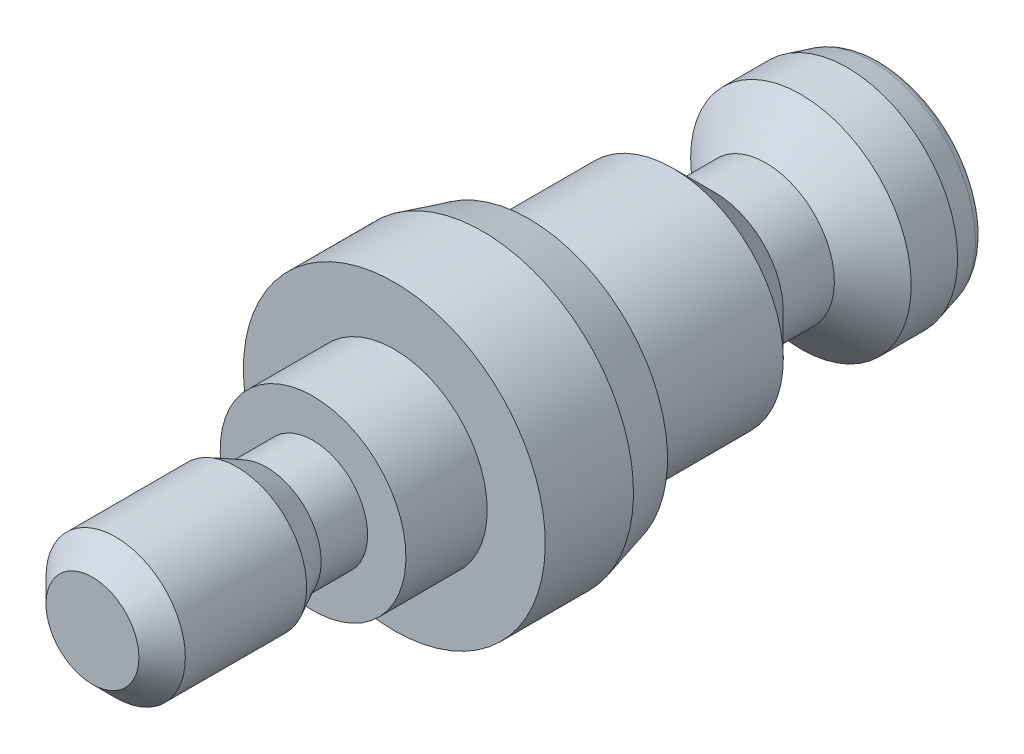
ISO-10303-21;
HEADER;
FILE_DESCRIPTION(('STEP AP214'),'2;1');
FILE_NAME('part.step','',(''),(''),'','','');
FILE_SCHEMA(('AUTOMOTIVE_DESIGN { 1 0 10303 214 1 1 1 1 }'));
ENDSEC;
DATA;
#1=APPLICATION_CONTEXT('core data for automotive mechanical design processes');
#2=APPLICATION_PROTOCOL_DEFINITION('international standard','automotive_design',2000,#1);
#3=PRODUCT_CONTEXT('',#1,'mechanical');
#4=PRODUCT('Part','Part','',(#3));
#5=PRODUCT_RELATED_PRODUCT_CATEGORY('part','',(#4));
#6=PRODUCT_DEFINITION_FORMATION('','',#4);
#7=PRODUCT_DEFINITION_CONTEXT('part definition',#1,'design');
#8=PRODUCT_DEFINITION('design','',#6,#7);
#9=PRODUCT_DEFINITION_SHAPE('','',#8);
#10=(LENGTH_UNIT() NAMED_UNIT(*) SI_UNIT(.MILLI.,.METRE.));
#11=(NAMED_UNIT(*) PLANE_ANGLE_UNIT() SI_UNIT($,.RADIAN.));
#12=(NAMED_UNIT(*) SI_UNIT($,.STERADIAN.) SOLID_ANGLE_UNIT());
#13=UNCERTAINTY_MEASURE_WITH_UNIT(LENGTH_MEASURE(1.E-05),#10,'distance_accuracy_value','');
#14=(GEOMETRIC_REPRESENTATION_CONTEXT(3) GLOBAL_UNCERTAINTY_ASSIGNED_CONTEXT((#13)) GLOBAL_UNIT_ASSIGNED_CONTEXT((#10,
#11,#12)) REPRESENTATION_CONTEXT('',''));
#15=CARTESIAN_POINT('',(0.,0.,0.));
#16=DIRECTION('',(0.,0.,1.));
#17=DIRECTION('',(1.,0.,0.));
#18=AXIS2_PLACEMENT_3D('',#15,#16,#17);
#19=CARTESIAN_POINT('',(0.,0.,0.));
#20=DIRECTION('',(0.,0.,-1.));
#21=DIRECTION('',(0.,1.,0.));
#22=AXIS2_PLACEMENT_3D('',#19,#20,#21);
#23=CYLINDRICAL_SURFACE('',#22,4.75);
#24=CARTESIAN_POINT('',(0.,0.,-12.));
#25=DIRECTION('',(0.,0.,-1.));
#26=DIRECTION('',(0.,1.,0.));
#27=AXIS2_PLACEMENT_3D('',#24,#25,#26);
#28=CIRCLE('',#27,4.75);
#29=CARTESIAN_POINT('',(0.,4.75000000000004,-12.));
#30=VERTEX_POINT('',#29);
#31=EDGE_CURVE('E142',#30,#30,#28,.T.);
#32=ORIENTED_EDGE('',*,*,#31,.F.);
#33=EDGE_LOOP('',(#32));
#34=FACE_BOUND('',#33,.T.);
#35=CARTESIAN_POINT('',(0.,0.,-5.8));
#36=DIRECTION('',(0.,0.,1.));
#37=DIRECTION('',(0.,-1.,0.));
#38=AXIS2_PLACEMENT_3D('',#35,#36,#37);
#39=CIRCLE('',#38,4.75);
#40=CARTESIAN_POINT('',(0.,-4.74999999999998,-5.80000000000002));
#41=VERTEX_POINT('',#40);
#42=EDGE_CURVE('E127',#41,#41,#39,.T.);
#43=ORIENTED_EDGE('',*,*,#42,.F.);
#44=EDGE_LOOP('',(#43));
#45=FACE_BOUND('',#44,.T.);
#46=ADVANCED_FACE('F16',(#34,#45),#23,.T.);
#47=CARTESIAN_POINT('',(0.,0.,-13.8));
#48=DIRECTION('',(0.,0.,1.));
#49=DIRECTION('',(0.,-1.,0.));
#50=AXIS2_PLACEMENT_3D('',#47,#48,#49);
#51=CONICAL_SURFACE('',#50,2.95,0.785398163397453);
#52=ORIENTED_EDGE('',*,*,#31,.T.);
#53=EDGE_LOOP('',(#52));
#54=FACE_BOUND('',#53,.T.);
#55=CARTESIAN_POINT('',(0.,0.,-13.8));
#56=DIRECTION('',(0.,0.,-1.));
#57=DIRECTION('',(0.,1.,0.));
#58=AXIS2_PLACEMENT_3D('',#55,#56,#57);
#59=CIRCLE('',#58,2.95);
#60=CARTESIAN_POINT('',(0.,2.95000000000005,-13.8));
#61=VERTEX_POINT('',#60);
#62=EDGE_CURVE('E139',#61,#61,#59,.T.);
#63=ORIENTED_EDGE('',*,*,#62,.F.);
#64=EDGE_LOOP('',(#63));
#65=FACE_BOUND('',#64,.T.);
#66=ADVANCED_FACE('F175',(#54,#65),#51,.T.);
#67=CARTESIAN_POINT('',(0.,0.,0.));
#68=DIRECTION('',(0.,0.,-1.));
#69=DIRECTION('',(0.,1.,0.));
#70=AXIS2_PLACEMENT_3D('',#67,#68,#69);
#71=CYLINDRICAL_SURFACE('',#70,2.95);
#72=ORIENTED_EDGE('',*,*,#62,.T.);
#73=EDGE_LOOP('',(#72));
#74=FACE_BOUND('',#73,.T.);
#75=CARTESIAN_POINT('',(0.,0.,-16.));
#76=DIRECTION('',(0.,0.,-1.));
#77=DIRECTION('',(0.,1.,0.));
#78=AXIS2_PLACEMENT_3D('',#75,#76,#77);
#79=CIRCLE('',#78,2.95);
#80=CARTESIAN_POINT('',(0.,2.95000000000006,-16.));
#81=VERTEX_POINT('',#80);
#82=EDGE_CURVE('E136',#81,#81,#79,.T.);
#83=ORIENTED_EDGE('',*,*,#82,.F.);
#84=EDGE_LOOP('',(#83));
#85=FACE_BOUND('',#84,.T.);
#86=ADVANCED_FACE('F181',(#74,#85),#71,.T.);
#87=CARTESIAN_POINT('',(0.,0.,-17.5103793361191));
#88=DIRECTION('',(0.,0.,-1.));
#89=DIRECTION('',(0.,1.,0.));
#90=AXIS2_PLACEMENT_3D('',#87,#88,#89);
#91=CONICAL_SURFACE('',#90,4.75,0.872664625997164);
#92=ORIENTED_EDGE('',*,*,#82,.T.);
#93=EDGE_LOOP('',(#92));
#94=FACE_BOUND('',#93,.T.);
#95=CARTESIAN_POINT('',(0.,0.,-17.5103793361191));
#96=DIRECTION('',(0.,0.,-1.));
#97=DIRECTION('',(0.,1.,0.));
#98=AXIS2_PLACEMENT_3D('',#95,#96,#97);
#99=CIRCLE('',#98,4.75);
#100=CARTESIAN_POINT('',(0.,4.75000000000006,-17.5103793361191));
#101=VERTEX_POINT('',#100);
#102=EDGE_CURVE('E133',#101,#101,#99,.T.);
#103=ORIENTED_EDGE('',*,*,#102,.F.);
#104=EDGE_LOOP('',(#103));
#105=FACE_BOUND('',#104,.T.);
#106=ADVANCED_FACE('F230',(#94,#105),#91,.T.);
#107=CARTESIAN_POINT('',(0.,0.,0.));
#108=DIRECTION('',(0.,0.,-1.));
#109=DIRECTION('',(0.,1.,0.));
#110=AXIS2_PLACEMENT_3D('',#107,#108,#109);
#111=CYLINDRICAL_SURFACE('',#110,4.75);
#112=ORIENTED_EDGE('',*,*,#102,.T.);
#113=EDGE_LOOP('',(#112));
#114=FACE_BOUND('',#113,.T.);
#115=CARTESIAN_POINT('',(0.,0.,-19.5103793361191));
#116=DIRECTION('',(0.,0.,-1.));
#117=DIRECTION('',(0.,1.,0.));
#118=AXIS2_PLACEMENT_3D('',#115,#116,#117);
#119=CIRCLE('',#118,4.75);
#120=CARTESIAN_POINT('',(0.,4.75000000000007,-19.5103793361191));
#121=VERTEX_POINT('',#120);
#122=EDGE_CURVE('E130',#121,#121,#119,.T.);
#123=ORIENTED_EDGE('',*,*,#122,.F.);
#124=EDGE_LOOP('',(#123));
#125=FACE_BOUND('',#124,.T.);
#126=ADVANCED_FACE('F221',(#114,#125),#111,.T.);
#127=CARTESIAN_POINT('',(0.,0.,-21.));
#128=DIRECTION('',(0.,0.,1.));
#129=DIRECTION('',(0.,-1.,0.));
#130=AXIS2_PLACEMENT_3D('',#127,#128,#129);
#131=CONICAL_SURFACE('',#130,4.3508573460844,0.26179938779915);
#132=CARTESIAN_POINT('',(0.,0.,-20.5552914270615));
#133=DIRECTION('',(0.,0.,-1.));
#134=DIRECTION('',(0.,1.,0.));
#135=AXIS2_PLACEMENT_3D('',#132,#133,#134);
#136=CIRCLE('',#135,4.47001664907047);
#137=CARTESIAN_POINT('',(0.,4.47001664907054,-20.5552914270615));
#138=VERTEX_POINT('',#137);
#139=EDGE_CURVE('E157',#138,#138,#136,.F.);
#140=ORIENTED_EDGE('',*,*,#139,.T.);
#141=EDGE_LOOP('',(#140));
#142=FACE_BOUND('',#141,.T.);
#143=ORIENTED_EDGE('',*,*,#122,.T.);
#144=EDGE_LOOP('',(#143));
#145=FACE_BOUND('',#144,.T.);
#146=ADVANCED_FACE('F213',(#142,#145),#131,.T.);
#147=CARTESIAN_POINT('',(4.3508573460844,0.,-21.));
#148=DIRECTION('',(0.,0.,-1.));
#149=DIRECTION('',(0.,1.,0.));
#150=AXIS2_PLACEMENT_3D('',#147,#148,#149);
#151=PLANE('',#150);
#152=DIRECTION('',(-0.866025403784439,0.5,0.));
#153=VECTOR('',#152,1.);
#154=CARTESIAN_POINT('',(0.,-1.73205080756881,-21.));
#155=LINE('',#154,#153);
#156=CARTESIAN_POINT('',(0.,-1.73205080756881,-21.));
#157=VERTEX_POINT('',#156);
#158=CARTESIAN_POINT('',(-1.5,-0.866025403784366,-21.));
#159=VERTEX_POINT('',#158);
#160=EDGE_CURVE('E448',#157,#159,#155,.T.);
#161=ORIENTED_EDGE('',*,*,#160,.F.);
#162=DIRECTION('',(-0.866025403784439,-0.5,0.));
#163=VECTOR('',#162,1.);
#164=CARTESIAN_POINT('',(1.5,-0.866025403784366,-21.));
#165=LINE('',#164,#163);
#166=CARTESIAN_POINT('',(1.5,-0.866025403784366,-21.));
#167=VERTEX_POINT('',#166);
#168=EDGE_CURVE('E99',#167,#157,#165,.T.);
#169=ORIENTED_EDGE('',*,*,#168,.F.);
#170=DIRECTION('',(0.,-1.,0.));
#171=VECTOR('',#170,1.);
#172=CARTESIAN_POINT('',(1.5,0.866025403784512,-21.));
#173=LINE('',#172,#171);
#174=CARTESIAN_POINT('',(1.5,0.866025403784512,-21.));
#175=VERTEX_POINT('',#174);
#176=EDGE_CURVE('E436',#175,#167,#173,.T.);
#177=ORIENTED_EDGE('',*,*,#176,.F.);
#178=DIRECTION('',(0.866025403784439,-0.5,0.));
#179=VECTOR('',#178,1.);
#180=CARTESIAN_POINT('',(0.,1.73205080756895,-21.));
#181=LINE('',#180,#179);
#182=CARTESIAN_POINT('',(0.,1.73205080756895,-21.));
#183=VERTEX_POINT('',#182);
#184=EDGE_CURVE('E435',#183,#175,#181,.T.);
#185=ORIENTED_EDGE('',*,*,#184,.F.);
#186=DIRECTION('',(0.866025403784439,0.5,0.));
#187=VECTOR('',#186,1.);
#188=CARTESIAN_POINT('',(-1.5,0.866025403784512,-21.));
#189=LINE('',#188,#187);
#190=CARTESIAN_POINT('',(-1.5,0.866025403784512,-21.));
#191=VERTEX_POINT('',#190);
#192=EDGE_CURVE('E437',#191,#183,#189,.T.);
#193=ORIENTED_EDGE('',*,*,#192,.F.);
#194=DIRECTION('',(0.,1.,0.));
#195=VECTOR('',#194,1.);
#196=CARTESIAN_POINT('',(-1.5,-0.866025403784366,-21.));
#197=LINE('',#196,#195);
#198=EDGE_CURVE('E56',#159,#191,#197,.T.);
#199=ORIENTED_EDGE('',*,*,#198,.F.);
#200=EDGE_LOOP('',(#161,#169,#177,#185,#193,#199));
#201=FACE_BOUND('',#200,.T.);
#202=CARTESIAN_POINT('',(0.,0.,-21.));
#203=DIRECTION('',(0.,0.,-1.));
#204=DIRECTION('',(0.,1.,0.));
#205=AXIS2_PLACEMENT_3D('',#202,#203,#204);
#206=CIRCLE('',#205,3.89046115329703);
#207=CARTESIAN_POINT('',(0.,3.8904611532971,-21.));
#208=VERTEX_POINT('',#207);
#209=EDGE_CURVE('E154',#208,#208,#206,.T.);
#210=ORIENTED_EDGE('',*,*,#209,.T.);
#211=EDGE_LOOP('',(#210));
#212=FACE_BOUND('',#211,.T.);
#213=ADVANCED_FACE('F210',(#201,#212),#151,.T.);
#214=CARTESIAN_POINT('',(4.75,0.,-5.8));
#215=DIRECTION('',(0.,0.,1.));
#216=DIRECTION('',(0.,-1.,0.));
#217=AXIS2_PLACEMENT_3D('',#214,#215,#216);
#218=PLANE('',#217);
#219=CARTESIAN_POINT('',(0.,0.,-5.8));
#220=DIRECTION('',(0.,0.,1.));
#221=DIRECTION('',(0.,-1.,0.));
#222=AXIS2_PLACEMENT_3D('',#219,#220,#221);
#223=CIRCLE('',#222,5.96410161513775);
#224=CARTESIAN_POINT('',(0.,-5.96410161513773,-5.80000000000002));
#225=VERTEX_POINT('',#224);
#226=EDGE_CURVE('E10',#225,#225,#223,.F.);
#227=ORIENTED_EDGE('',*,*,#226,.T.);
#228=EDGE_LOOP('',(#227));
#229=FACE_BOUND('',#228,.T.);
#230=ORIENTED_EDGE('',*,*,#42,.T.);
#231=EDGE_LOOP('',(#230));
#232=FACE_BOUND('',#231,.T.);
#233=ADVANCED_FACE('F212',(#229,#232),#218,.F.);
#234=CARTESIAN_POINT('',(0.,0.,0.));
#235=DIRECTION('',(0.,0.,1.));
#236=DIRECTION('',(0.,-1.,0.));
#237=AXIS2_PLACEMENT_3D('',#234,#235,#236);
#238=CYLINDRICAL_SURFACE('',#237,6.5);
#239=CARTESIAN_POINT('',(0.,0.,-3.8));
#240=DIRECTION('',(0.,0.,1.));
#241=DIRECTION('',(0.,-1.,0.));
#242=AXIS2_PLACEMENT_3D('',#239,#240,#241);
#243=CIRCLE('',#242,6.5);
#244=CARTESIAN_POINT('',(0.,-6.49999999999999,-3.80000000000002));
#245=VERTEX_POINT('',#244);
#246=EDGE_CURVE('E25',#245,#245,#243,.T.);
#247=ORIENTED_EDGE('',*,*,#246,.T.);
#248=EDGE_LOOP('',(#247));
#249=FACE_BOUND('',#248,.T.);
#250=CARTESIAN_POINT('',(0.,0.,0.));
#251=DIRECTION('',(0.,0.,1.));
#252=DIRECTION('',(0.,-1.,0.));
#253=AXIS2_PLACEMENT_3D('',#250,#251,#252);
#254=CIRCLE('',#253,6.5);
#255=CARTESIAN_POINT('',(0.,-6.5,0.));
#256=VERTEX_POINT('',#255);
#257=EDGE_CURVE('E124',#256,#256,#254,.T.);
#258=ORIENTED_EDGE('',*,*,#257,.F.);
#259=EDGE_LOOP('',(#258));
#260=FACE_BOUND('',#259,.T.);
#261=ADVANCED_FACE('F162',(#249,#260),#238,.T.);
#262=CARTESIAN_POINT('',(0.,0.,0.));
#263=DIRECTION('',(0.,0.,1.));
#264=DIRECTION('',(0.,-1.,0.));
#265=AXIS2_PLACEMENT_3D('',#262,#263,#264);
#266=PLANE('',#265);
#267=CARTESIAN_POINT('',(0.,0.,0.));
#268=DIRECTION('',(0.,0.,1.));
#269=DIRECTION('',(0.,-1.,0.));
#270=AXIS2_PLACEMENT_3D('',#267,#268,#269);
#271=CIRCLE('',#270,4.);
#272=CARTESIAN_POINT('',(0.,-4.,0.));
#273=VERTEX_POINT('',#272);
#274=EDGE_CURVE('E145',#273,#273,#271,.T.);
#275=ORIENTED_EDGE('',*,*,#274,.F.);
#276=EDGE_LOOP('',(#275));
#277=FACE_BOUND('',#276,.T.);
#278=ORIENTED_EDGE('',*,*,#257,.T.);
#279=EDGE_LOOP('',(#278));
#280=FACE_BOUND('',#279,.T.);
#281=ADVANCED_FACE('F188',(#277,#280),#266,.T.);
#282=CARTESIAN_POINT('',(3.,0.,3.5));
#283=DIRECTION('',(0.,0.,1.));
#284=DIRECTION('',(0.,-1.,0.));
#285=AXIS2_PLACEMENT_3D('',#282,#283,#284);
#286=PLANE('',#285);
#287=CARTESIAN_POINT('',(0.,0.,3.5));
#288=DIRECTION('',(0.,0.,-1.));
#289=DIRECTION('',(0.,1.,0.));
#290=AXIS2_PLACEMENT_3D('',#287,#288,#289);
#291=CIRCLE('',#290,4.);
#292=CARTESIAN_POINT('',(0.,3.99999999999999,3.50000000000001));
#293=VERTEX_POINT('',#292);
#294=EDGE_CURVE('E121',#293,#293,#291,.T.);
#295=ORIENTED_EDGE('',*,*,#294,.F.);
#296=EDGE_LOOP('',(#295));
#297=FACE_BOUND('',#296,.T.);
#298=CARTESIAN_POINT('',(0.,0.,3.5));
#299=DIRECTION('',(0.,0.,-1.));
#300=DIRECTION('',(0.,1.,0.));
#301=AXIS2_PLACEMENT_3D('',#298,#299,#300);
#302=CIRCLE('',#301,2.35);
#303=CARTESIAN_POINT('',(0.,2.34999999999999,3.50000000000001));
#304=VERTEX_POINT('',#303);
#305=EDGE_CURVE('E112',#304,#304,#302,.T.);
#306=ORIENTED_EDGE('',*,*,#305,.T.);
#307=EDGE_LOOP('',(#306));
#308=FACE_BOUND('',#307,.T.);
#309=ADVANCED_FACE('F191',(#297,#308),#286,.T.);
#310=CARTESIAN_POINT('',(0.,0.,0.));
#311=DIRECTION('',(0.,0.,-1.));
#312=DIRECTION('',(0.,1.,0.));
#313=AXIS2_PLACEMENT_3D('',#310,#311,#312);
#314=CYLINDRICAL_SURFACE('',#313,4.);
#315=ORIENTED_EDGE('',*,*,#294,.T.);
#316=EDGE_LOOP('',(#315));
#317=FACE_BOUND('',#316,.T.);
#318=ORIENTED_EDGE('',*,*,#274,.T.);
#319=EDGE_LOOP('',(#318));
#320=FACE_BOUND('',#319,.T.);
#321=ADVANCED_FACE('F308',(#317,#320),#314,.T.);
#322=CARTESIAN_POINT('',(0.,0.,6.77569682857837));
#323=DIRECTION('',(0.,0.,1.));
#324=DIRECTION('',(0.,-1.,0.));
#325=AXIS2_PLACEMENT_3D('',#322,#323,#324);
#326=CONICAL_SURFACE('',#325,3.,0.471238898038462);
#327=CARTESIAN_POINT('',(0.,0.,5.5));
#328=DIRECTION('',(0.,0.,-1.));
#329=DIRECTION('',(0.,1.,0.));
#330=AXIS2_PLACEMENT_3D('',#327,#328,#329);
#331=CIRCLE('',#330,2.35);
#332=CARTESIAN_POINT('',(0.,2.34999999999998,5.50000000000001));
#333=VERTEX_POINT('',#332);
#334=EDGE_CURVE('E115',#333,#333,#331,.T.);
#335=ORIENTED_EDGE('',*,*,#334,.F.);
#336=EDGE_LOOP('',(#335));
#337=FACE_BOUND('',#336,.T.);
#338=CARTESIAN_POINT('',(0.,0.,6.77569682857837));
#339=DIRECTION('',(0.,0.,-1.));
#340=DIRECTION('',(0.,1.,0.));
#341=AXIS2_PLACEMENT_3D('',#338,#339,#340);
#342=CIRCLE('',#341,3.);
#343=CARTESIAN_POINT('',(0.,2.99999999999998,6.77569682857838));
#344=VERTEX_POINT('',#343);
#345=EDGE_CURVE('E118',#344,#344,#342,.T.);
#346=ORIENTED_EDGE('',*,*,#345,.T.);
#347=EDGE_LOOP('',(#346));
#348=FACE_BOUND('',#347,.T.);
#349=ADVANCED_FACE('F318',(#337,#348),#326,.T.);
#350=CARTESIAN_POINT('',(0.,0.,0.));
#351=DIRECTION('',(0.,0.,-1.));
#352=DIRECTION('',(0.,1.,0.));
#353=AXIS2_PLACEMENT_3D('',#350,#351,#352);
#354=CYLINDRICAL_SURFACE('',#353,2.35);
#355=ORIENTED_EDGE('',*,*,#305,.F.);
#356=EDGE_LOOP('',(#355));
#357=FACE_BOUND('',#356,.T.);
#358=ORIENTED_EDGE('',*,*,#334,.T.);
#359=EDGE_LOOP('',(#358));
#360=FACE_BOUND('',#359,.T.);
#361=ADVANCED_FACE('F329',(#357,#360),#354,.T.);
#362=CARTESIAN_POINT('',(0.,0.,13.));
#363=DIRECTION('',(0.,0.,1.));
#364=DIRECTION('',(0.,-1.,0.));
#365=AXIS2_PLACEMENT_3D('',#362,#363,#364);
#366=PLANE('',#365);
#367=CARTESIAN_POINT('',(0.,0.,13.));
#368=DIRECTION('',(0.,0.,1.));
#369=DIRECTION('',(0.,-1.,0.));
#370=AXIS2_PLACEMENT_3D('',#367,#368,#369);
#371=CIRCLE('',#370,2.);
#372=CARTESIAN_POINT('',(0.,-2.00000000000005,13.));
#373=VERTEX_POINT('',#372);
#374=EDGE_CURVE('E151',#373,#373,#371,.T.);
#375=ORIENTED_EDGE('',*,*,#374,.T.);
#376=EDGE_LOOP('',(#375));
#377=FACE_BOUND('',#376,.T.);
#378=ADVANCED_FACE('F225',(#377),#366,.T.);
#379=CARTESIAN_POINT('',(0.,0.,0.));
#380=DIRECTION('',(0.,0.,-1.));
#381=DIRECTION('',(0.,1.,0.));
#382=AXIS2_PLACEMENT_3D('',#379,#380,#381);
#383=CYLINDRICAL_SURFACE('',#382,3.);
#384=CARTESIAN_POINT('',(0.,0.,12.));
#385=DIRECTION('',(0.,0.,1.));
#386=DIRECTION('',(0.,-1.,0.));
#387=AXIS2_PLACEMENT_3D('',#384,#385,#386);
#388=CIRCLE('',#387,3.);
#389=CARTESIAN_POINT('',(0.,-3.00000000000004,12.));
#390=VERTEX_POINT('',#389);
#391=EDGE_CURVE('E148',#390,#390,#388,.F.);
#392=ORIENTED_EDGE('',*,*,#391,.T.);
#393=EDGE_LOOP('',(#392));
#394=FACE_BOUND('',#393,.T.);
#395=ORIENTED_EDGE('',*,*,#345,.F.);
#396=EDGE_LOOP('',(#395));
#397=FACE_BOUND('',#396,.T.);
#398=ADVANCED_FACE('F196',(#394,#397),#383,.T.);
#399=CARTESIAN_POINT('',(0.,0.,12.));
#400=DIRECTION('',(0.,0.,-1.));
#401=DIRECTION('',(0.,1.,0.));
#402=AXIS2_PLACEMENT_3D('',#399,#400,#401);
#403=CONICAL_SURFACE('',#402,3.,0.785398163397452);
#404=ORIENTED_EDGE('',*,*,#374,.F.);
#405=EDGE_LOOP('',(#404));
#406=FACE_BOUND('',#405,.T.);
#407=ORIENTED_EDGE('',*,*,#391,.F.);
#408=EDGE_LOOP('',(#407));
#409=FACE_BOUND('',#408,.T.);
#410=ADVANCED_FACE('F193',(#406,#409),#403,.T.);
#411=CARTESIAN_POINT('',(0.,0.,-20.4));
#412=DIRECTION('',(0.,0.,-1.));
#413=DIRECTION('',(0.,1.,0.));
#414=AXIS2_PLACEMENT_3D('',#411,#412,#413);
#415=TOROIDAL_SURFACE('',#414,3.89046115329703,0.6);
#416=ORIENTED_EDGE('',*,*,#139,.F.);
#417=EDGE_LOOP('',(#416));
#418=FACE_BOUND('',#417,.T.);
#419=ORIENTED_EDGE('',*,*,#209,.F.);
#420=EDGE_LOOP('',(#419));
#421=FACE_BOUND('',#420,.T.);
#422=ADVANCED_FACE('F195',(#418,#421),#415,.T.);
#423=CARTESIAN_POINT('',(-1.5,0.866025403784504,-18.5));
#424=DIRECTION('',(-0.5,0.866025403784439,0.));
#425=DIRECTION('',(-0.866025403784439,-0.5,0.));
#426=AXIS2_PLACEMENT_3D('',#423,#424,#425);
#427=PLANE('',#426);
#428=ORIENTED_EDGE('',*,*,#192,.T.);
#429=DIRECTION('',(0.,0.,-1.));
#430=VECTOR('',#429,1.);
#431=CARTESIAN_POINT('',(0.,1.73205080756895,-18.5));
#432=LINE('',#431,#430);
#433=CARTESIAN_POINT('',(0.,1.73205080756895,-18.5));
#434=VERTEX_POINT('',#433);
#435=EDGE_CURVE('E110',#434,#183,#432,.T.);
#436=ORIENTED_EDGE('',*,*,#435,.F.);
#437=DIRECTION('',(0.866025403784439,0.5,0.));
#438=VECTOR('',#437,1.);
#439=CARTESIAN_POINT('',(-1.5,0.866025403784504,-18.5));
#440=LINE('',#439,#438);
#441=CARTESIAN_POINT('',(-1.5,0.866025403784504,-18.5));
#442=VERTEX_POINT('',#441);
#443=EDGE_CURVE('E33',#442,#434,#440,.T.);
#444=ORIENTED_EDGE('',*,*,#443,.F.);
#445=DIRECTION('',(0.,0.,-1.));
#446=VECTOR('',#445,1.);
#447=CARTESIAN_POINT('',(-1.5,0.866025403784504,-18.5));
#448=LINE('',#447,#446);
#449=EDGE_CURVE('E102',#442,#191,#448,.T.);
#450=ORIENTED_EDGE('',*,*,#449,.T.);
#451=EDGE_LOOP('',(#428,#436,#444,#450));
#452=FACE_BOUND('',#451,.T.);
#453=ADVANCED_FACE('F199',(#452),#427,.F.);
#454=CARTESIAN_POINT('',(-1.5,-0.866025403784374,-18.5));
#455=DIRECTION('',(-1.,0.,0.));
#456=DIRECTION('',(0.,-1.,0.));
#457=AXIS2_PLACEMENT_3D('',#454,#455,#456);
#458=PLANE('',#457);
#459=ORIENTED_EDGE('',*,*,#198,.T.);
#460=ORIENTED_EDGE('',*,*,#449,.F.);
#461=DIRECTION('',(0.,1.,0.));
#462=VECTOR('',#461,1.);
#463=CARTESIAN_POINT('',(-1.5,-0.866025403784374,-18.5));
#464=LINE('',#463,#462);
#465=CARTESIAN_POINT('',(-1.5,-0.866025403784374,-18.5));
#466=VERTEX_POINT('',#465);
#467=EDGE_CURVE('E87',#466,#442,#464,.T.);
#468=ORIENTED_EDGE('',*,*,#467,.F.);
#469=DIRECTION('',(0.,0.,-1.));
#470=VECTOR('',#469,1.);
#471=CARTESIAN_POINT('',(-1.5,-0.866025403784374,-18.5));
#472=LINE('',#471,#470);
#473=EDGE_CURVE('E85',#466,#159,#472,.T.);
#474=ORIENTED_EDGE('',*,*,#473,.T.);
#475=EDGE_LOOP('',(#459,#460,#468,#474));
#476=FACE_BOUND('',#475,.T.);
#477=ADVANCED_FACE('F204',(#476),#458,.F.);
#478=CARTESIAN_POINT('',(0.,-1.73205080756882,-18.5));
#479=DIRECTION('',(-0.5,-0.866025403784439,0.));
#480=DIRECTION('',(0.866025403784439,-0.5,0.));
#481=AXIS2_PLACEMENT_3D('',#478,#479,#480);
#482=PLANE('',#481);
#483=ORIENTED_EDGE('',*,*,#160,.T.);
#484=ORIENTED_EDGE('',*,*,#473,.F.);
#485=DIRECTION('',(-0.866025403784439,0.5,0.));
#486=VECTOR('',#485,1.);
#487=CARTESIAN_POINT('',(0.,-1.73205080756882,-18.5));
#488=LINE('',#487,#486);
#489=CARTESIAN_POINT('',(0.,-1.73205080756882,-18.5));
#490=VERTEX_POINT('',#489);
#491=EDGE_CURVE('E80',#490,#466,#488,.T.);
#492=ORIENTED_EDGE('',*,*,#491,.F.);
#493=DIRECTION('',(0.,0.,-1.));
#494=VECTOR('',#493,1.);
#495=CARTESIAN_POINT('',(0.,-1.73205080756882,-18.5));
#496=LINE('',#495,#494);
#497=EDGE_CURVE('E84',#490,#157,#496,.T.);
#498=ORIENTED_EDGE('',*,*,#497,.T.);
#499=EDGE_LOOP('',(#483,#484,#492,#498));
#500=FACE_BOUND('',#499,.T.);
#501=ADVANCED_FACE('F82',(#500),#482,.F.);
#502=CARTESIAN_POINT('',(1.5,-0.866025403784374,-18.5));
#503=DIRECTION('',(0.5,-0.866025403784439,0.));
#504=DIRECTION('',(0.866025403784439,0.5,0.));
#505=AXIS2_PLACEMENT_3D('',#502,#503,#504);
#506=PLANE('',#505);
#507=ORIENTED_EDGE('',*,*,#168,.T.);
#508=ORIENTED_EDGE('',*,*,#497,.F.);
#509=DIRECTION('',(-0.866025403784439,-0.5,0.));
#510=VECTOR('',#509,1.);
#511=CARTESIAN_POINT('',(1.5,-0.866025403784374,-18.5));
#512=LINE('',#511,#510);
#513=CARTESIAN_POINT('',(1.5,-0.866025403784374,-18.5));
#514=VERTEX_POINT('',#513);
#515=EDGE_CURVE('E88',#514,#490,#512,.T.);
#516=ORIENTED_EDGE('',*,*,#515,.F.);
#517=DIRECTION('',(0.,0.,-1.));
#518=VECTOR('',#517,1.);
#519=CARTESIAN_POINT('',(1.5,-0.866025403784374,-18.5));
#520=LINE('',#519,#518);
#521=EDGE_CURVE('E100',#514,#167,#520,.T.);
#522=ORIENTED_EDGE('',*,*,#521,.T.);
#523=EDGE_LOOP('',(#507,#508,#516,#522));
#524=FACE_BOUND('',#523,.T.);
#525=ADVANCED_FACE('F98',(#524),#506,.F.);
#526=CARTESIAN_POINT('',(1.5,0.866025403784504,-18.5));
#527=DIRECTION('',(1.,0.,0.));
#528=DIRECTION('',(0.,1.,0.));
#529=AXIS2_PLACEMENT_3D('',#526,#527,#528);
#530=PLANE('',#529);
#531=ORIENTED_EDGE('',*,*,#176,.T.);
#532=ORIENTED_EDGE('',*,*,#521,.F.);
#533=DIRECTION('',(0.,-1.,0.));
#534=VECTOR('',#533,1.);
#535=CARTESIAN_POINT('',(1.5,0.866025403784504,-18.5));
#536=LINE('',#535,#534);
#537=CARTESIAN_POINT('',(1.5,0.866025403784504,-18.5));
#538=VERTEX_POINT('',#537);
#539=EDGE_CURVE('E92',#538,#514,#536,.T.);
#540=ORIENTED_EDGE('',*,*,#539,.F.);
#541=DIRECTION('',(0.,0.,-1.));
#542=VECTOR('',#541,1.);
#543=CARTESIAN_POINT('',(1.5,0.866025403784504,-18.5));
#544=LINE('',#543,#542);
#545=EDGE_CURVE('E104',#538,#175,#544,.T.);
#546=ORIENTED_EDGE('',*,*,#545,.T.);
#547=EDGE_LOOP('',(#531,#532,#540,#546));
#548=FACE_BOUND('',#547,.T.);
#549=ADVANCED_FACE('F391',(#548),#530,.F.);
#550=CARTESIAN_POINT('',(0.,1.73205080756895,-18.5));
#551=DIRECTION('',(0.5,0.866025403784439,0.));
#552=DIRECTION('',(-0.866025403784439,0.5,0.));
#553=AXIS2_PLACEMENT_3D('',#550,#551,#552);
#554=PLANE('',#553);
#555=ORIENTED_EDGE('',*,*,#184,.T.);
#556=ORIENTED_EDGE('',*,*,#545,.F.);
#557=DIRECTION('',(0.866025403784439,-0.5,0.));
#558=VECTOR('',#557,1.);
#559=CARTESIAN_POINT('',(0.,1.73205080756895,-18.5));
#560=LINE('',#559,#558);
#561=EDGE_CURVE('E69',#434,#538,#560,.T.);
#562=ORIENTED_EDGE('',*,*,#561,.F.);
#563=ORIENTED_EDGE('',*,*,#435,.T.);
#564=EDGE_LOOP('',(#555,#556,#562,#563));
#565=FACE_BOUND('',#564,.T.);
#566=ADVANCED_FACE('F171',(#565),#554,.F.);
#567=CARTESIAN_POINT('',(0.,0.,-18.5));
#568=DIRECTION('',(0.,0.,-1.));
#569=DIRECTION('',(0.,1.,0.));
#570=AXIS2_PLACEMENT_3D('',#567,#568,#569);
#571=PLANE('',#570);
#572=ORIENTED_EDGE('',*,*,#467,.T.);
#573=ORIENTED_EDGE('',*,*,#443,.T.);
#574=ORIENTED_EDGE('',*,*,#561,.T.);
#575=ORIENTED_EDGE('',*,*,#539,.T.);
#576=ORIENTED_EDGE('',*,*,#515,.T.);
#577=ORIENTED_EDGE('',*,*,#491,.T.);
#578=EDGE_LOOP('',(#572,#573,#574,#575,#576,#577));
#579=FACE_BOUND('',#578,.T.);
#580=ADVANCED_FACE('F91',(#579),#571,.T.);
#581=CARTESIAN_POINT('',(0.,0.,-3.8));
#582=DIRECTION('',(0.,0.,1.));
#583=DIRECTION('',(0.,-1.,0.));
#584=AXIS2_PLACEMENT_3D('',#581,#582,#583);
#585=CONICAL_SURFACE('',#584,6.5,0.261799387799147);
#586=ORIENTED_EDGE('',*,*,#226,.F.);
#587=EDGE_LOOP('',(#586));
#588=FACE_BOUND('',#587,.T.);
#589=ORIENTED_EDGE('',*,*,#246,.F.);
#590=EDGE_LOOP('',(#589));
#591=FACE_BOUND('',#590,.T.);
#592=ADVANCED_FACE('F18',(#588,#591),#585,.T.);
#593=CLOSED_SHELL('',(#46,#66,#86,#106,#126,#146,#213,#233,#261,#281,#309,#321,#349,#361,#378,
#398,#410,#422,#453,#477,#501,#525,#549,#566,#580,#592));
#594=MANIFOLD_SOLID_BREP('B1',#593);
#595=ADVANCED_BREP_SHAPE_REPRESENTATION('',(#18,#594),#14);
#596=SHAPE_DEFINITION_REPRESENTATION(#9,#595);
ENDSEC;
END-ISO-10303-21;
